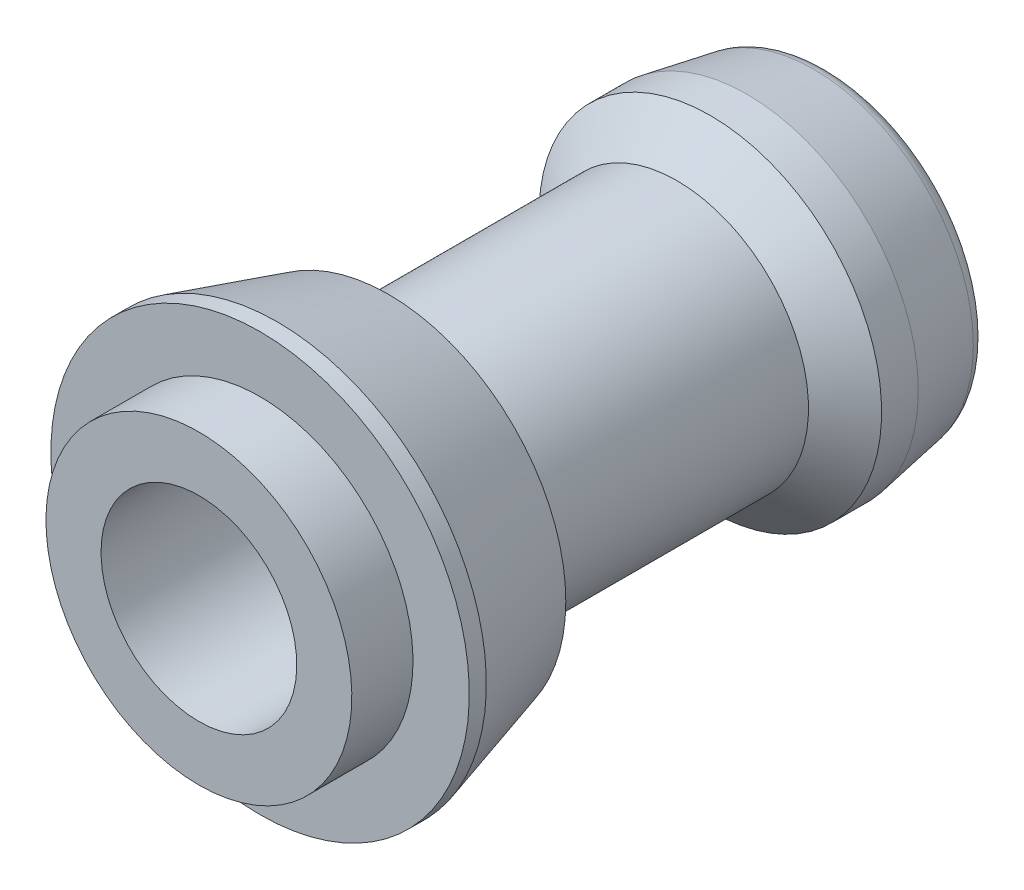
ISO-10303-21;
HEADER;
FILE_DESCRIPTION(('STEP AP214'),'2;1');
FILE_NAME('part.step','',(''),(''),'','','');
FILE_SCHEMA(('AUTOMOTIVE_DESIGN { 1 0 10303 214 1 1 1 1 }'));
ENDSEC;
DATA;
#1=APPLICATION_CONTEXT('core data for automotive mechanical design processes');
#2=APPLICATION_PROTOCOL_DEFINITION('international standard','automotive_design',2000,#1);
#3=PRODUCT_CONTEXT('',#1,'mechanical');
#4=PRODUCT('Part','Part','',(#3));
#5=PRODUCT_RELATED_PRODUCT_CATEGORY('part','',(#4));
#6=PRODUCT_DEFINITION_FORMATION('','',#4);
#7=PRODUCT_DEFINITION_CONTEXT('part definition',#1,'design');
#8=PRODUCT_DEFINITION('design','',#6,#7);
#9=PRODUCT_DEFINITION_SHAPE('','',#8);
#10=(LENGTH_UNIT() NAMED_UNIT(*) SI_UNIT(.MILLI.,.METRE.));
#11=(NAMED_UNIT(*) PLANE_ANGLE_UNIT() SI_UNIT($,.RADIAN.));
#12=(NAMED_UNIT(*) SI_UNIT($,.STERADIAN.) SOLID_ANGLE_UNIT());
#13=UNCERTAINTY_MEASURE_WITH_UNIT(LENGTH_MEASURE(1.E-05),#10,'distance_accuracy_value','');
#14=(GEOMETRIC_REPRESENTATION_CONTEXT(3) GLOBAL_UNCERTAINTY_ASSIGNED_CONTEXT((#13)) GLOBAL_UNIT_ASSIGNED_CONTEXT((#10,
#11,#12)) REPRESENTATION_CONTEXT('',''));
#15=CARTESIAN_POINT('',(0.,0.,0.));
#16=DIRECTION('',(0.,0.,1.));
#17=DIRECTION('',(1.,0.,0.));
#18=AXIS2_PLACEMENT_3D('',#15,#16,#17);
#19=CARTESIAN_POINT('',(0.,0.,5.));
#20=DIRECTION('',(0.,0.,1.));
#21=DIRECTION('',(0.,-1.,0.));
#22=AXIS2_PLACEMENT_3D('',#19,#20,#21);
#23=CYLINDRICAL_SURFACE('',#22,7.);
#24=CARTESIAN_POINT('',(0.,0.,-25.));
#25=DIRECTION('',(0.,0.,1.));
#26=DIRECTION('',(0.,-1.,0.));
#27=AXIS2_PLACEMENT_3D('',#24,#25,#26);
#28=CIRCLE('',#27,7.);
#29=CARTESIAN_POINT('',(0.,-6.99999999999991,-25.));
#30=VERTEX_POINT('',#29);
#31=EDGE_CURVE('E131',#30,#30,#28,.T.);
#32=ORIENTED_EDGE('',*,*,#31,.T.);
#33=EDGE_LOOP('',(#32));
#34=FACE_BOUND('',#33,.T.);
#35=CARTESIAN_POINT('',(0.,1.08235921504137E-13,-31.));
#36=DIRECTION('',(0.,0.,-1.));
#37=DIRECTION('',(1.,0.,0.));
#38=AXIS2_PLACEMENT_3D('',#35,#36,#37);
#39=CIRCLE('',#38,7.);
#40=CARTESIAN_POINT('',(7.,1.08235921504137E-13,-31.));
#41=VERTEX_POINT('',#40);
#42=EDGE_CURVE('E10',#41,#41,#39,.F.);
#43=ORIENTED_EDGE('',*,*,#42,.F.);
#44=EDGE_LOOP('',(#43));
#45=FACE_BOUND('',#44,.T.);
#46=ADVANCED_FACE('F16',(#34,#45),#23,.F.);
#47=CARTESIAN_POINT('',(0.,0.,0.));
#48=DIRECTION('',(0.,0.,1.));
#49=DIRECTION('',(0.,-1.,0.));
#50=AXIS2_PLACEMENT_3D('',#47,#48,#49);
#51=PLANE('',#50);
#52=CARTESIAN_POINT('',(0.,0.,0.));
#53=DIRECTION('',(0.,0.,1.));
#54=DIRECTION('',(0.,-1.,0.));
#55=AXIS2_PLACEMENT_3D('',#52,#53,#54);
#56=CIRCLE('',#55,17.1);
#57=CARTESIAN_POINT('',(0.,-17.1,0.));
#58=VERTEX_POINT('',#57);
#59=EDGE_CURVE('E20',#58,#58,#56,.F.);
#60=ORIENTED_EDGE('',*,*,#59,.F.);
#61=EDGE_LOOP('',(#60));
#62=FACE_BOUND('',#61,.T.);
#63=CARTESIAN_POINT('',(0.,0.,0.));
#64=DIRECTION('',(0.,0.,1.));
#65=DIRECTION('',(0.,-1.,0.));
#66=AXIS2_PLACEMENT_3D('',#63,#64,#65);
#67=CIRCLE('',#66,12.5);
#68=CARTESIAN_POINT('',(0.,-12.5,0.));
#69=VERTEX_POINT('',#68);
#70=EDGE_CURVE('E144',#69,#69,#67,.T.);
#71=ORIENTED_EDGE('',*,*,#70,.F.);
#72=EDGE_LOOP('',(#71));
#73=FACE_BOUND('',#72,.T.);
#74=ADVANCED_FACE('F173',(#62,#73),#51,.T.);
#75=CARTESIAN_POINT('',(0.,0.,0.));
#76=DIRECTION('',(0.,0.,-1.));
#77=DIRECTION('',(0.,1.,0.));
#78=AXIS2_PLACEMENT_3D('',#75,#76,#77);
#79=CYLINDRICAL_SURFACE('',#78,17.1);
#80=ORIENTED_EDGE('',*,*,#59,.T.);
#81=EDGE_LOOP('',(#80));
#82=FACE_BOUND('',#81,.T.);
#83=CARTESIAN_POINT('',(0.,0.,-1.39496577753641));
#84=DIRECTION('',(0.,0.,-1.));
#85=DIRECTION('',(0.,1.,0.));
#86=AXIS2_PLACEMENT_3D('',#83,#84,#85);
#87=CIRCLE('',#86,17.1);
#88=CARTESIAN_POINT('',(0.,17.1,-1.39496577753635));
#89=VERTEX_POINT('',#88);
#90=EDGE_CURVE('E140',#89,#89,#87,.T.);
#91=ORIENTED_EDGE('',*,*,#90,.F.);
#92=EDGE_LOOP('',(#91));
#93=FACE_BOUND('',#92,.T.);
#94=ADVANCED_FACE('F170',(#82,#93),#79,.T.);
#95=CARTESIAN_POINT('',(0.,0.,-10.5));
#96=DIRECTION('',(0.,0.,1.));
#97=DIRECTION('',(0.,-1.,0.));
#98=AXIS2_PLACEMENT_3D('',#95,#96,#97);
#99=CONICAL_SURFACE('',#98,14.4891734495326,0.279252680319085);
#100=ORIENTED_EDGE('',*,*,#90,.T.);
#101=EDGE_LOOP('',(#100));
#102=FACE_BOUND('',#101,.T.);
#103=CARTESIAN_POINT('',(0.,0.,-10.5));
#104=DIRECTION('',(0.,0.,-1.));
#105=DIRECTION('',(0.,1.,0.));
#106=AXIS2_PLACEMENT_3D('',#103,#104,#105);
#107=CIRCLE('',#106,14.4891734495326);
#108=CARTESIAN_POINT('',(0.,14.4891734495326,-10.5));
#109=VERTEX_POINT('',#108);
#110=EDGE_CURVE('E137',#109,#109,#107,.T.);
#111=ORIENTED_EDGE('',*,*,#110,.F.);
#112=EDGE_LOOP('',(#111));
#113=FACE_BOUND('',#112,.T.);
#114=ADVANCED_FACE('F335',(#102,#113),#99,.T.);
#115=CARTESIAN_POINT('',(0.,0.,-12.6588127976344));
#116=DIRECTION('',(0.,0.,1.));
#117=DIRECTION('',(0.,-1.,0.));
#118=AXIS2_PLACEMENT_3D('',#115,#116,#117);
#119=CONICAL_SURFACE('',#118,10.75,1.0471975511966);
#120=CARTESIAN_POINT('',(0.,0.,-12.6588127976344));
#121=DIRECTION('',(0.,0.,1.));
#122=DIRECTION('',(0.,-1.,0.));
#123=AXIS2_PLACEMENT_3D('',#120,#121,#122);
#124=CIRCLE('',#123,10.75);
#125=CARTESIAN_POINT('',(0.,-10.75,-12.6588127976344));
#126=VERTEX_POINT('',#125);
#127=EDGE_CURVE('E148',#126,#126,#124,.T.);
#128=ORIENTED_EDGE('',*,*,#127,.T.);
#129=EDGE_LOOP('',(#128));
#130=FACE_BOUND('',#129,.T.);
#131=ORIENTED_EDGE('',*,*,#110,.T.);
#132=EDGE_LOOP('',(#131));
#133=FACE_BOUND('',#132,.T.);
#134=ADVANCED_FACE('F326',(#130,#133),#119,.T.);
#135=CARTESIAN_POINT('',(0.,0.,0.));
#136=DIRECTION('',(0.,0.,1.));
#137=DIRECTION('',(0.,-1.,0.));
#138=AXIS2_PLACEMENT_3D('',#135,#136,#137);
#139=CYLINDRICAL_SURFACE('',#138,10.75);
#140=ORIENTED_EDGE('',*,*,#127,.F.);
#141=EDGE_LOOP('',(#140));
#142=FACE_BOUND('',#141,.T.);
#143=CARTESIAN_POINT('',(0.,1.18964985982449E-13,-34.0729261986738));
#144=DIRECTION('',(0.,0.,-1.));
#145=DIRECTION('',(0.,1.,0.));
#146=AXIS2_PLACEMENT_3D('',#143,#144,#145);
#147=CIRCLE('',#146,10.75);
#148=CARTESIAN_POINT('',(0.,10.7500000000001,-34.0729261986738));
#149=VERTEX_POINT('',#148);
#150=EDGE_CURVE('E143',#149,#149,#147,.F.);
#151=ORIENTED_EDGE('',*,*,#150,.T.);
#152=EDGE_LOOP('',(#151));
#153=FACE_BOUND('',#152,.T.);
#154=ADVANCED_FACE('F317',(#142,#153),#139,.T.);
#155=CARTESIAN_POINT('',(0.,1.28486513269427E-13,-36.8));
#156=DIRECTION('',(0.,0.,-1.));
#157=DIRECTION('',(0.,1.,0.));
#158=AXIS2_PLACEMENT_3D('',#155,#156,#157);
#159=CONICAL_SURFACE('',#158,14.,0.872664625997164);
#160=CARTESIAN_POINT('',(0.,1.28486513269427E-13,-36.8));
#161=DIRECTION('',(0.,0.,-1.));
#162=DIRECTION('',(0.,1.,0.));
#163=AXIS2_PLACEMENT_3D('',#160,#161,#162);
#164=CIRCLE('',#163,14.);
#165=CARTESIAN_POINT('',(0.,14.0000000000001,-36.7999999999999));
#166=VERTEX_POINT('',#165);
#167=EDGE_CURVE('E155',#166,#166,#164,.F.);
#168=ORIENTED_EDGE('',*,*,#167,.T.);
#169=EDGE_LOOP('',(#168));
#170=FACE_BOUND('',#169,.T.);
#171=ORIENTED_EDGE('',*,*,#150,.F.);
#172=EDGE_LOOP('',(#171));
#173=FACE_BOUND('',#172,.T.);
#174=ADVANCED_FACE('F308',(#170,#173),#159,.T.);
#175=CARTESIAN_POINT('',(0.,0.,0.));
#176=DIRECTION('',(0.,0.,1.));
#177=DIRECTION('',(0.,-1.,0.));
#178=AXIS2_PLACEMENT_3D('',#175,#176,#177);
#179=CYLINDRICAL_SURFACE('',#178,14.);
#180=ORIENTED_EDGE('',*,*,#167,.F.);
#181=EDGE_LOOP('',(#180));
#182=FACE_BOUND('',#181,.T.);
#183=CARTESIAN_POINT('',(0.,1.38960957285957E-13,-39.8));
#184=DIRECTION('',(0.,0.,1.));
#185=DIRECTION('',(0.,-1.,0.));
#186=AXIS2_PLACEMENT_3D('',#183,#184,#185);
#187=CIRCLE('',#186,14.);
#188=CARTESIAN_POINT('',(0.,-13.9999999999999,-39.8000000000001));
#189=VERTEX_POINT('',#188);
#190=EDGE_CURVE('E134',#189,#189,#187,.T.);
#191=ORIENTED_EDGE('',*,*,#190,.T.);
#192=EDGE_LOOP('',(#191));
#193=FACE_BOUND('',#192,.T.);
#194=ADVANCED_FACE('F299',(#182,#193),#179,.T.);
#195=CARTESIAN_POINT('',(0.,1.62353882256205E-13,-46.5));
#196=DIRECTION('',(0.,0.,1.));
#197=DIRECTION('',(0.,-1.,0.));
#198=AXIS2_PLACEMENT_3D('',#195,#196,#197);
#199=CONICAL_SURFACE('',#198,12.8186092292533,0.174532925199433);
#200=CARTESIAN_POINT('',(0.,1.58026094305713E-13,-45.2604722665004));
#201=DIRECTION('',(0.,0.,-1.));
#202=DIRECTION('',(0.,1.,0.));
#203=AXIS2_PLACEMENT_3D('',#200,#201,#202);
#204=CIRCLE('',#203,13.0371714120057);
#205=CARTESIAN_POINT('',(0.,13.0371714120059,-45.2604722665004));
#206=VERTEX_POINT('',#205);
#207=EDGE_CURVE('E147',#206,#206,#204,.F.);
#208=ORIENTED_EDGE('',*,*,#207,.T.);
#209=EDGE_LOOP('',(#208));
#210=FACE_BOUND('',#209,.T.);
#211=ORIENTED_EDGE('',*,*,#190,.F.);
#212=EDGE_LOOP('',(#211));
#213=FACE_BOUND('',#212,.T.);
#214=ADVANCED_FACE('F289',(#210,#213),#199,.T.);
#215=CARTESIAN_POINT('',(12.8186092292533,1.62353882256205E-13,-46.5));
#216=DIRECTION('',(0.,0.,1.));
#217=DIRECTION('',(0.,-1.,0.));
#218=AXIS2_PLACEMENT_3D('',#215,#216,#217);
#219=PLANE('',#218);
#220=CARTESIAN_POINT('',(0.,1.62353882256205E-13,-46.5));
#221=DIRECTION('',(0.,0.,1.));
#222=DIRECTION('',(0.,-1.,0.));
#223=AXIS2_PLACEMENT_3D('',#220,#221,#222);
#224=CIRCLE('',#223,9.25);
#225=CARTESIAN_POINT('',(0.,-9.24999999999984,-46.5));
#226=VERTEX_POINT('',#225);
#227=EDGE_CURVE('E153',#226,#226,#224,.T.);
#228=ORIENTED_EDGE('',*,*,#227,.T.);
#229=EDGE_LOOP('',(#228));
#230=FACE_BOUND('',#229,.T.);
#231=CARTESIAN_POINT('',(0.,1.62353882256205E-13,-46.5));
#232=DIRECTION('',(0.,0.,1.));
#233=DIRECTION('',(0.,-1.,0.));
#234=AXIS2_PLACEMENT_3D('',#231,#232,#233);
#235=CIRCLE('',#234,11.5599597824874);
#236=CARTESIAN_POINT('',(0.,-11.5599597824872,-46.5));
#237=VERTEX_POINT('',#236);
#238=EDGE_CURVE('E151',#237,#237,#235,.F.);
#239=ORIENTED_EDGE('',*,*,#238,.T.);
#240=EDGE_LOOP('',(#239));
#241=FACE_BOUND('',#240,.T.);
#242=ADVANCED_FACE('F189',(#230,#241),#219,.F.);
#243=CARTESIAN_POINT('',(0.,0.,5.));
#244=DIRECTION('',(0.,0.,1.));
#245=DIRECTION('',(0.,-1.,0.));
#246=AXIS2_PLACEMENT_3D('',#243,#244,#245);
#247=PLANE('',#246);
#248=CARTESIAN_POINT('',(0.,0.,5.));
#249=DIRECTION('',(0.,0.,1.));
#250=DIRECTION('',(0.,-1.,0.));
#251=AXIS2_PLACEMENT_3D('',#248,#249,#250);
#252=CIRCLE('',#251,12.5);
#253=CARTESIAN_POINT('',(0.,-12.5,4.99999999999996));
#254=VERTEX_POINT('',#253);
#255=EDGE_CURVE('E163',#254,#254,#252,.F.);
#256=ORIENTED_EDGE('',*,*,#255,.F.);
#257=EDGE_LOOP('',(#256));
#258=FACE_BOUND('',#257,.T.);
#259=CARTESIAN_POINT('',(0.,0.,5.));
#260=DIRECTION('',(0.,0.,1.));
#261=DIRECTION('',(0.,-1.,0.));
#262=AXIS2_PLACEMENT_3D('',#259,#260,#261);
#263=CIRCLE('',#262,8.);
#264=CARTESIAN_POINT('',(0.,-8.00000000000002,4.99999999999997));
#265=VERTEX_POINT('',#264);
#266=EDGE_CURVE('E125',#265,#265,#263,.T.);
#267=ORIENTED_EDGE('',*,*,#266,.F.);
#268=EDGE_LOOP('',(#267));
#269=FACE_BOUND('',#268,.T.);
#270=ADVANCED_FACE('F180',(#258,#269),#247,.T.);
#271=CARTESIAN_POINT('',(0.,0.,0.));
#272=DIRECTION('',(0.,0.,-1.));
#273=DIRECTION('',(0.,1.,0.));
#274=AXIS2_PLACEMENT_3D('',#271,#272,#273);
#275=CYLINDRICAL_SURFACE('',#274,12.5);
#276=ORIENTED_EDGE('',*,*,#255,.T.);
#277=EDGE_LOOP('',(#276));
#278=FACE_BOUND('',#277,.T.);
#279=ORIENTED_EDGE('',*,*,#70,.T.);
#280=EDGE_LOOP('',(#279));
#281=FACE_BOUND('',#280,.T.);
#282=ADVANCED_FACE('F178',(#278,#281),#275,.T.);
#283=CARTESIAN_POINT('',(0.,1.57116660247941E-13,-45.));
#284=DIRECTION('',(0.,0.,1.));
#285=DIRECTION('',(0.,-1.,0.));
#286=AXIS2_PLACEMENT_3D('',#283,#284,#285);
#287=TOROIDAL_SURFACE('',#286,11.5599597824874,1.5);
#288=ORIENTED_EDGE('',*,*,#238,.F.);
#289=EDGE_LOOP('',(#288));
#290=FACE_BOUND('',#289,.T.);
#291=ORIENTED_EDGE('',*,*,#207,.F.);
#292=EDGE_LOOP('',(#291));
#293=FACE_BOUND('',#292,.T.);
#294=ADVANCED_FACE('F18',(#290,#293),#287,.T.);
#295=CARTESIAN_POINT('',(8.,0.,-25.));
#296=DIRECTION('',(0.,0.,-1.));
#297=DIRECTION('',(0.,1.,0.));
#298=AXIS2_PLACEMENT_3D('',#295,#296,#297);
#299=PLANE('',#298);
#300=ORIENTED_EDGE('',*,*,#31,.F.);
#301=EDGE_LOOP('',(#300));
#302=FACE_BOUND('',#301,.T.);
#303=CARTESIAN_POINT('',(0.,0.,-25.));
#304=DIRECTION('',(0.,0.,1.));
#305=DIRECTION('',(0.,-1.,0.));
#306=AXIS2_PLACEMENT_3D('',#303,#304,#305);
#307=CIRCLE('',#306,8.);
#308=CARTESIAN_POINT('',(0.,-7.99999999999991,-25.));
#309=VERTEX_POINT('',#308);
#310=EDGE_CURVE('E128',#309,#309,#307,.T.);
#311=ORIENTED_EDGE('',*,*,#310,.T.);
#312=EDGE_LOOP('',(#311));
#313=FACE_BOUND('',#312,.T.);
#314=ADVANCED_FACE('F187',(#302,#313),#299,.F.);
#315=CARTESIAN_POINT('',(0.,0.,5.));
#316=DIRECTION('',(0.,0.,1.));
#317=DIRECTION('',(0.,-1.,0.));
#318=AXIS2_PLACEMENT_3D('',#315,#316,#317);
#319=CYLINDRICAL_SURFACE('',#318,8.);
#320=ORIENTED_EDGE('',*,*,#310,.F.);
#321=EDGE_LOOP('',(#320));
#322=FACE_BOUND('',#321,.T.);
#323=ORIENTED_EDGE('',*,*,#266,.T.);
#324=EDGE_LOOP('',(#323));
#325=FACE_BOUND('',#324,.T.);
#326=ADVANCED_FACE('F201',(#322,#325),#319,.F.);
#327=CARTESIAN_POINT('',(9.25,1.36167772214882E-13,-39.));
#328=DIRECTION('',(0.,0.,-1.));
#329=DIRECTION('',(0.,1.,0.));
#330=AXIS2_PLACEMENT_3D('',#327,#328,#329);
#331=PLANE('',#330);
#332=DIRECTION('',(0.5,0.866025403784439,0.));
#333=VECTOR('',#332,1.);
#334=CARTESIAN_POINT('',(-6.92820323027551,1.37032010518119E-13,-39.));
#335=LINE('',#334,#333);
#336=CARTESIAN_POINT('',(-6.92820323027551,1.37032010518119E-13,-39.));
#337=VERTEX_POINT('',#336);
#338=CARTESIAN_POINT('',(-3.46410161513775,6.00000000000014,-39.));
#339=VERTEX_POINT('',#338);
#340=EDGE_CURVE('E98',#337,#339,#335,.T.);
#341=ORIENTED_EDGE('',*,*,#340,.F.);
#342=DIRECTION('',(-0.5,0.866025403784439,0.));
#343=VECTOR('',#342,1.);
#344=CARTESIAN_POINT('',(-3.46410161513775,-5.99999999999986,-39.));
#345=LINE('',#344,#343);
#346=CARTESIAN_POINT('',(-3.46410161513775,-5.99999999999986,-39.));
#347=VERTEX_POINT('',#346);
#348=EDGE_CURVE('E95',#347,#337,#345,.T.);
#349=ORIENTED_EDGE('',*,*,#348,.F.);
#350=DIRECTION('',(-1.,0.,0.));
#351=VECTOR('',#350,1.);
#352=CARTESIAN_POINT('',(3.46410161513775,-5.99999999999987,-39.));
#353=LINE('',#352,#351);
#354=CARTESIAN_POINT('',(3.46410161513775,-5.99999999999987,-39.));
#355=VERTEX_POINT('',#354);
#356=EDGE_CURVE('E77',#355,#347,#353,.T.);
#357=ORIENTED_EDGE('',*,*,#356,.F.);
#358=DIRECTION('',(-0.5,-0.866025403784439,0.));
#359=VECTOR('',#358,1.);
#360=CARTESIAN_POINT('',(6.92820323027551,1.37032747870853E-13,-39.));
#361=LINE('',#360,#359);
#362=CARTESIAN_POINT('',(6.92820323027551,1.37032747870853E-13,-39.));
#363=VERTEX_POINT('',#362);
#364=EDGE_CURVE('E68',#363,#355,#361,.T.);
#365=ORIENTED_EDGE('',*,*,#364,.F.);
#366=DIRECTION('',(0.5,-0.866025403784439,0.));
#367=VECTOR('',#366,1.);
#368=CARTESIAN_POINT('',(3.46410161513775,6.00000000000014,-39.));
#369=LINE('',#368,#367);
#370=CARTESIAN_POINT('',(3.46410161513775,6.00000000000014,-39.));
#371=VERTEX_POINT('',#370);
#372=EDGE_CURVE('E74',#371,#363,#369,.T.);
#373=ORIENTED_EDGE('',*,*,#372,.F.);
#374=DIRECTION('',(1.,0.,0.));
#375=VECTOR('',#374,1.);
#376=CARTESIAN_POINT('',(-3.46410161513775,6.00000000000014,-39.));
#377=LINE('',#376,#375);
#378=EDGE_CURVE('E86',#339,#371,#377,.T.);
#379=ORIENTED_EDGE('',*,*,#378,.F.);
#380=EDGE_LOOP('',(#341,#349,#357,#365,#373,#379));
#381=FACE_BOUND('',#380,.T.);
#382=CARTESIAN_POINT('',(0.,1.36167772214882E-13,-39.));
#383=DIRECTION('',(0.,0.,1.));
#384=DIRECTION('',(0.,-1.,0.));
#385=AXIS2_PLACEMENT_3D('',#382,#383,#384);
#386=CIRCLE('',#385,9.25);
#387=CARTESIAN_POINT('',(0.,-9.24999999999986,-39.));
#388=VERTEX_POINT('',#387);
#389=EDGE_CURVE('E122',#388,#388,#386,.T.);
#390=ORIENTED_EDGE('',*,*,#389,.F.);
#391=EDGE_LOOP('',(#390));
#392=FACE_BOUND('',#391,.T.);
#393=ADVANCED_FACE('F70',(#381,#392),#331,.T.);
#394=CARTESIAN_POINT('',(0.,0.,0.));
#395=DIRECTION('',(0.,0.,1.));
#396=DIRECTION('',(0.,-1.,0.));
#397=AXIS2_PLACEMENT_3D('',#394,#395,#396);
#398=CYLINDRICAL_SURFACE('',#397,9.25);
#399=ORIENTED_EDGE('',*,*,#227,.F.);
#400=EDGE_LOOP('',(#399));
#401=FACE_BOUND('',#400,.T.);
#402=ORIENTED_EDGE('',*,*,#389,.T.);
#403=EDGE_LOOP('',(#402));
#404=FACE_BOUND('',#403,.T.);
#405=ADVANCED_FACE('F206',(#401,#404),#398,.F.);
#406=CARTESIAN_POINT('',(7.,1.08235921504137E-13,-31.));
#407=DIRECTION('',(0.,0.,-1.));
#408=DIRECTION('',(1.,0.,0.));
#409=AXIS2_PLACEMENT_3D('',#406,#407,#408);
#410=PLANE('',#409);
#411=DIRECTION('',(-0.5,0.866025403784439,0.));
#412=VECTOR('',#411,1.);
#413=CARTESIAN_POINT('',(-3.44615242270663,-6.03108891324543,-31.));
#414=LINE('',#413,#412);
#415=CARTESIAN_POINT('',(-3.46410161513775,-5.99999999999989,-31.));
#416=VERTEX_POINT('',#415);
#417=CARTESIAN_POINT('',(-6.92820323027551,1.09100159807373E-13,-31.));
#418=VERTEX_POINT('',#417);
#419=EDGE_CURVE('E115',#416,#418,#414,.T.);
#420=ORIENTED_EDGE('',*,*,#419,.T.);
#421=DIRECTION('',(0.5,0.866025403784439,0.));
#422=VECTOR('',#421,1.);
#423=CARTESIAN_POINT('',(-3.44615242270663,6.03108891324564,-31.));
#424=LINE('',#423,#422);
#425=CARTESIAN_POINT('',(-3.46410161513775,6.00000000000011,-31.));
#426=VERTEX_POINT('',#425);
#427=EDGE_CURVE('E117',#418,#426,#424,.T.);
#428=ORIENTED_EDGE('',*,*,#427,.T.);
#429=DIRECTION('',(1.,0.,0.));
#430=VECTOR('',#429,1.);
#431=CARTESIAN_POINT('',(7.,6.00000000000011,-31.));
#432=LINE('',#431,#430);
#433=CARTESIAN_POINT('',(3.46410161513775,6.00000000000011,-31.));
#434=VERTEX_POINT('',#433);
#435=EDGE_CURVE('E38',#426,#434,#432,.T.);
#436=ORIENTED_EDGE('',*,*,#435,.T.);
#437=DIRECTION('',(0.5,-0.866025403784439,0.));
#438=VECTOR('',#437,1.);
#439=CARTESIAN_POINT('',(6.94615242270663,-0.0310889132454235,-31.));
#440=LINE('',#439,#438);
#441=CARTESIAN_POINT('',(6.92820323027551,1.09100897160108E-13,-31.));
#442=VERTEX_POINT('',#441);
#443=EDGE_CURVE('E120',#434,#442,#440,.T.);
#444=ORIENTED_EDGE('',*,*,#443,.T.);
#445=DIRECTION('',(-0.5,-0.866025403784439,0.));
#446=VECTOR('',#445,1.);
#447=CARTESIAN_POINT('',(6.94615242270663,0.0310889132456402,-31.));
#448=LINE('',#447,#446);
#449=CARTESIAN_POINT('',(3.46410161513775,-5.99999999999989,-31.));
#450=VERTEX_POINT('',#449);
#451=EDGE_CURVE('E32',#442,#450,#448,.T.);
#452=ORIENTED_EDGE('',*,*,#451,.T.);
#453=DIRECTION('',(-1.,0.,0.));
#454=VECTOR('',#453,1.);
#455=CARTESIAN_POINT('',(7.,-5.99999999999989,-31.));
#456=LINE('',#455,#454);
#457=EDGE_CURVE('E113',#450,#416,#456,.T.);
#458=ORIENTED_EDGE('',*,*,#457,.T.);
#459=EDGE_LOOP('',(#420,#428,#436,#444,#452,#458));
#460=FACE_BOUND('',#459,.T.);
#461=ORIENTED_EDGE('',*,*,#42,.T.);
#462=EDGE_LOOP('',(#461));
#463=FACE_BOUND('',#462,.T.);
#464=ADVANCED_FACE('F209',(#460,#463),#410,.F.);
#465=CARTESIAN_POINT('',(3.46410161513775,6.,5.));
#466=DIRECTION('',(0.866025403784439,0.5,0.));
#467=DIRECTION('',(-0.5,0.866025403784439,0.));
#468=AXIS2_PLACEMENT_3D('',#465,#466,#467);
#469=PLANE('',#468);
#470=DIRECTION('',(0.,0.,-1.));
#471=VECTOR('',#470,1.);
#472=CARTESIAN_POINT('',(3.46410161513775,6.,5.));
#473=LINE('',#472,#471);
#474=EDGE_CURVE('E91',#434,#371,#473,.T.);
#475=ORIENTED_EDGE('',*,*,#474,.T.);
#476=ORIENTED_EDGE('',*,*,#372,.T.);
#477=DIRECTION('',(0.,0.,-1.));
#478=VECTOR('',#477,1.);
#479=CARTESIAN_POINT('',(6.92820323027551,0.,5.));
#480=LINE('',#479,#478);
#481=EDGE_CURVE('E82',#442,#363,#480,.T.);
#482=ORIENTED_EDGE('',*,*,#481,.F.);
#483=ORIENTED_EDGE('',*,*,#443,.F.);
#484=EDGE_LOOP('',(#475,#476,#482,#483));
#485=FACE_BOUND('',#484,.T.);
#486=ADVANCED_FACE('F89',(#485),#469,.F.);
#487=CARTESIAN_POINT('',(-3.46410161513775,6.,5.));
#488=DIRECTION('',(0.,1.,0.));
#489=DIRECTION('',(-1.,0.,0.));
#490=AXIS2_PLACEMENT_3D('',#487,#488,#489);
#491=PLANE('',#490);
#492=DIRECTION('',(0.,0.,-1.));
#493=VECTOR('',#492,1.);
#494=CARTESIAN_POINT('',(-3.46410161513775,6.,5.));
#495=LINE('',#494,#493);
#496=EDGE_CURVE('E103',#426,#339,#495,.T.);
#497=ORIENTED_EDGE('',*,*,#496,.T.);
#498=ORIENTED_EDGE('',*,*,#378,.T.);
#499=ORIENTED_EDGE('',*,*,#474,.F.);
#500=ORIENTED_EDGE('',*,*,#435,.F.);
#501=EDGE_LOOP('',(#497,#498,#499,#500));
#502=FACE_BOUND('',#501,.T.);
#503=ADVANCED_FACE('F217',(#502),#491,.F.);
#504=CARTESIAN_POINT('',(-6.92820323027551,0.,5.));
#505=DIRECTION('',(-0.866025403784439,0.5,0.));
#506=DIRECTION('',(-0.5,-0.866025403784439,0.));
#507=AXIS2_PLACEMENT_3D('',#504,#505,#506);
#508=PLANE('',#507);
#509=DIRECTION('',(0.,0.,-1.));
#510=VECTOR('',#509,1.);
#511=CARTESIAN_POINT('',(-6.92820323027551,0.,5.));
#512=LINE('',#511,#510);
#513=EDGE_CURVE('E105',#418,#337,#512,.T.);
#514=ORIENTED_EDGE('',*,*,#513,.T.);
#515=ORIENTED_EDGE('',*,*,#340,.T.);
#516=ORIENTED_EDGE('',*,*,#496,.F.);
#517=ORIENTED_EDGE('',*,*,#427,.F.);
#518=EDGE_LOOP('',(#514,#515,#516,#517));
#519=FACE_BOUND('',#518,.T.);
#520=ADVANCED_FACE('F227',(#519),#508,.F.);
#521=CARTESIAN_POINT('',(-3.46410161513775,-6.,5.));
#522=DIRECTION('',(-0.866025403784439,-0.5,0.));
#523=DIRECTION('',(0.5,-0.866025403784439,0.));
#524=AXIS2_PLACEMENT_3D('',#521,#522,#523);
#525=PLANE('',#524);
#526=DIRECTION('',(0.,0.,-1.));
#527=VECTOR('',#526,1.);
#528=CARTESIAN_POINT('',(-3.46410161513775,-6.,5.));
#529=LINE('',#528,#527);
#530=EDGE_CURVE('E108',#416,#347,#529,.T.);
#531=ORIENTED_EDGE('',*,*,#530,.T.);
#532=ORIENTED_EDGE('',*,*,#348,.T.);
#533=ORIENTED_EDGE('',*,*,#513,.F.);
#534=ORIENTED_EDGE('',*,*,#419,.F.);
#535=EDGE_LOOP('',(#531,#532,#533,#534));
#536=FACE_BOUND('',#535,.T.);
#537=ADVANCED_FACE('F223',(#536),#525,.F.);
#538=CARTESIAN_POINT('',(3.46410161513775,-6.,5.));
#539=DIRECTION('',(0.,-1.,0.));
#540=DIRECTION('',(1.,0.,0.));
#541=AXIS2_PLACEMENT_3D('',#538,#539,#540);
#542=PLANE('',#541);
#543=DIRECTION('',(0.,0.,-1.));
#544=VECTOR('',#543,1.);
#545=CARTESIAN_POINT('',(3.46410161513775,-6.,5.));
#546=LINE('',#545,#544);
#547=EDGE_CURVE('E85',#450,#355,#546,.T.);
#548=ORIENTED_EDGE('',*,*,#547,.T.);
#549=ORIENTED_EDGE('',*,*,#356,.T.);
#550=ORIENTED_EDGE('',*,*,#530,.F.);
#551=ORIENTED_EDGE('',*,*,#457,.F.);
#552=EDGE_LOOP('',(#548,#549,#550,#551));
#553=FACE_BOUND('',#552,.T.);
#554=ADVANCED_FACE('F220',(#553),#542,.F.);
#555=CARTESIAN_POINT('',(6.92820323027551,0.,5.));
#556=DIRECTION('',(0.866025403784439,-0.5,0.));
#557=DIRECTION('',(0.5,0.866025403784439,0.));
#558=AXIS2_PLACEMENT_3D('',#555,#556,#557);
#559=PLANE('',#558);
#560=ORIENTED_EDGE('',*,*,#481,.T.);
#561=ORIENTED_EDGE('',*,*,#364,.T.);
#562=ORIENTED_EDGE('',*,*,#547,.F.);
#563=ORIENTED_EDGE('',*,*,#451,.F.);
#564=EDGE_LOOP('',(#560,#561,#562,#563));
#565=FACE_BOUND('',#564,.T.);
#566=ADVANCED_FACE('F83',(#565),#559,.F.);
#567=CLOSED_SHELL('',(#46,#74,#94,#114,#134,#154,#174,#194,#214,#242,#270,#282,#294,#314,#326,
#393,#405,#464,#486,#503,#520,#537,#554,#566));
#568=MANIFOLD_SOLID_BREP('B1',#567);
#569=ADVANCED_BREP_SHAPE_REPRESENTATION('',(#18,#568),#14);
#570=SHAPE_DEFINITION_REPRESENTATION(#9,#569);
ENDSEC;
END-ISO-10303-21;
